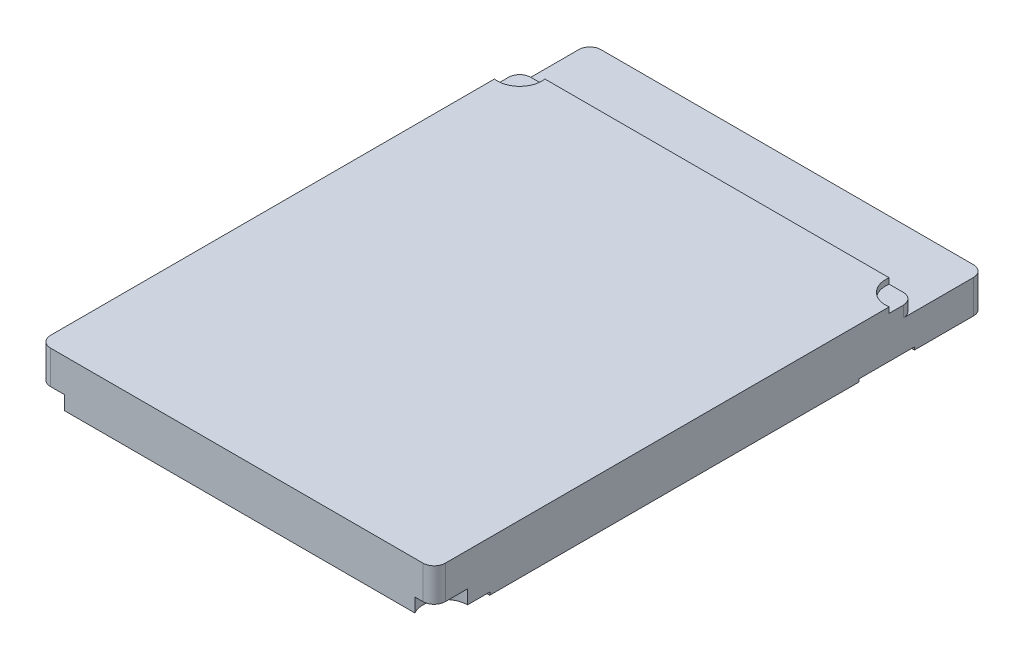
from build123d import *

# Parameters (mm, degrees)
SKIZZE1_W                       = 71
SKIZZE1_H                       = 9
LINEAR_AUSTRAGEN1_DEPTH         = 99
SKIZZE2_W                       = 71
SKIZZE2_H                       = 12.618848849
SCHNITT_LINEAR_AUSTRAGEN1_DEPTH = 3
VERRUNDUNG1_R                   = 2
VERRUNDUNG2_R                   = 2
SKIZZE3_R                       = 4
SCHNITT_LINEAR_AUSTRAGEN2_DEPTH = 3
SKIZZE4_R                       = 4
SCHNITT_LINEAR_AUSTRAGEN3_DEPTH = 1
SKIZZE6_W                       = 10
SKIZZE6_H                       = 1.55693541
SCHNITT_LINEAR_AUSTRAGEN4_DEPTH = 123.954525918
SKIZZE7_W                       = 10
SKIZZE7_H                       = 2.188916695
SCHNITT_LINEAR_AUSTRAGEN5_DEPTH = 123.954525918


with BuildPart() as part:
    # Skizze1 → Linear austragen1 (new body)
    with BuildSketch(Plane.XY):
        with Locations((54.709965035, -12.107692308)):
            Rectangle(SKIZZE1_W, SKIZZE1_H)
    extrude(amount=LINEAR_AUSTRAGEN1_DEPTH)

    # Skizze2 → Schnitt-Linear austragen1 (cut)
    with BuildSketch(Plane(origin=(0, -7.607692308, 0), x_dir=(1, 0, 0), z_dir=(0, 1, 0))):
        with Locations((54.709965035, -6.309424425)):
            Rectangle(SKIZZE2_W, SKIZZE2_H)
    extrude(amount=-SCHNITT_LINEAR_AUSTRAGEN1_DEPTH, mode=Mode.SUBTRACT)

    # Verrundung1
    verrundung1_edges = [part.edges().sort_by_distance(p)[0] for p in [
        (19.209965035, -13.607692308, 0),
        (19.209965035, -9.107692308, 12.618848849),
        (90.209965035, -9.107692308, 12.618848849),
        (90.209965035, -13.607692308, 0),
    ]]
    fillet(verrundung1_edges, radius=VERRUNDUNG1_R)

    # Verrundung2
    verrundung2_edges = [part.edges().sort_by_distance(p)[0] for p in [
        (90.209965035, -12.107692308, 99),
        (19.209965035, -12.107692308, 99),
    ]]
    fillet(verrundung2_edges, radius=VERRUNDUNG2_R)

    # Skizze3 → Schnitt-Linear austragen2 (cut)
    with BuildSketch(Plane.XZ.offset(16.607692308)):
        with Locations((19.795751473, 98.414213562)):
            Circle(SKIZZE3_R)
        with Locations((90.209965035, 97)):
            Circle(SKIZZE3_R)
    extrude(amount=-SCHNITT_LINEAR_AUSTRAGEN2_DEPTH, mode=Mode.SUBTRACT)

    # Skizze4 → Schnitt-Linear austragen3 (cut)
    with BuildSketch(Plane(origin=(0, -7.607692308, 0), x_dir=(1, 0, 0), z_dir=(0, 1, 0))):
        with Locations((19.795751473, -13.204635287)):
            Circle(SKIZZE4_R)
        with Locations((89.624178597, -13.204635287)):
            Circle(SKIZZE4_R)
    extrude(amount=-SCHNITT_LINEAR_AUSTRAGEN3_DEPTH, mode=Mode.SUBTRACT)

    # Skizze6 → Schnitt-Linear austragen4 (cut, through all)
    with BuildSketch(Plane.ZY.offset(-19.209965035)):
        with Locations((17.618848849, -16.886160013)):
            Rectangle(SKIZZE6_W, SKIZZE6_H)
    extrude(amount=-SCHNITT_LINEAR_AUSTRAGEN4_DEPTH, mode=Mode.SUBTRACT)

    # Skizze7 → Schnitt-Linear austragen5 (cut, through all)
    with BuildSketch(Plane.ZY.offset(-19.209965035)):
        with Locations((94, -17.202150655)):
            Rectangle(SKIZZE7_W, SKIZZE7_H)
    extrude(amount=-SCHNITT_LINEAR_AUSTRAGEN5_DEPTH, mode=Mode.SUBTRACT)


solid = part.part
